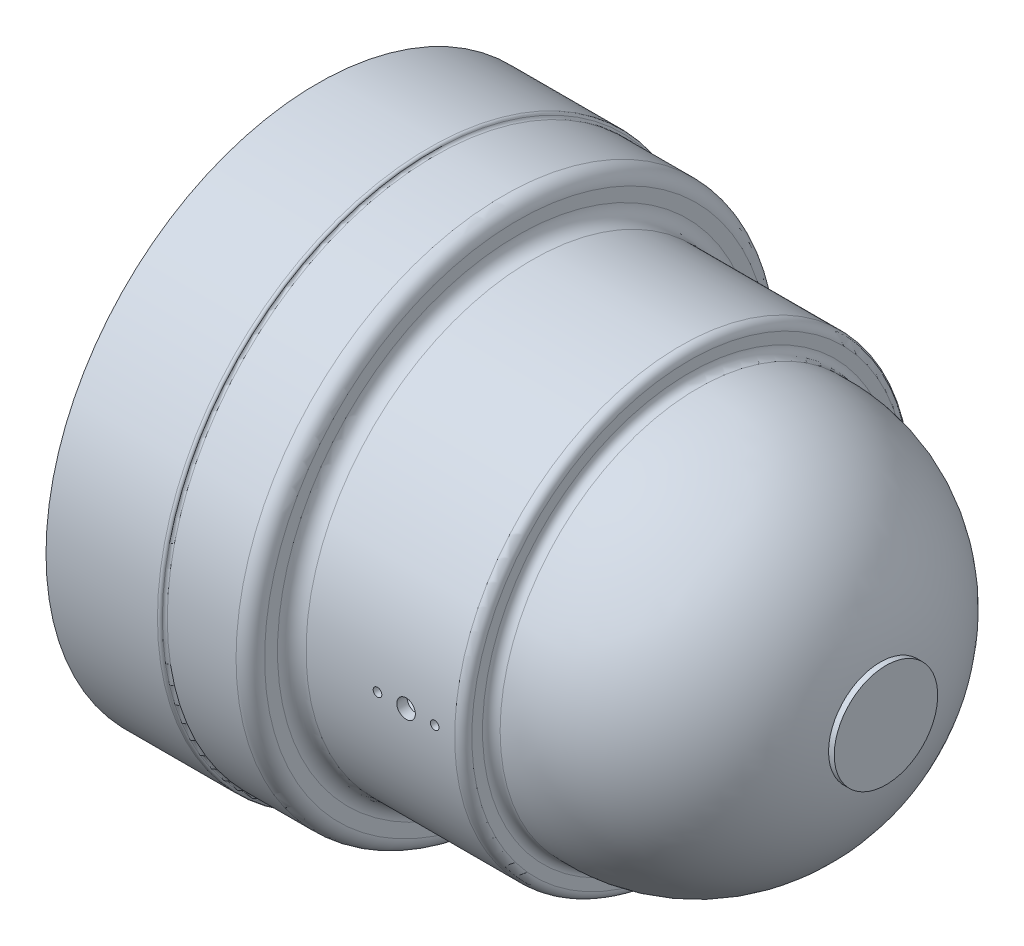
ISO-10303-21;
HEADER;
FILE_DESCRIPTION(('STEP AP214'),'2;1');
FILE_NAME('part.step','',(''),(''),'','','');
FILE_SCHEMA(('AUTOMOTIVE_DESIGN { 1 0 10303 214 1 1 1 1 }'));
ENDSEC;
DATA;
#1=APPLICATION_CONTEXT('core data for automotive mechanical design processes');
#2=APPLICATION_PROTOCOL_DEFINITION('international standard','automotive_design',2000,#1);
#3=PRODUCT_CONTEXT('',#1,'mechanical');
#4=PRODUCT('Part','Part','',(#3));
#5=PRODUCT_RELATED_PRODUCT_CATEGORY('part','',(#4));
#6=PRODUCT_DEFINITION_FORMATION('','',#4);
#7=PRODUCT_DEFINITION_CONTEXT('part definition',#1,'design');
#8=PRODUCT_DEFINITION('design','',#6,#7);
#9=PRODUCT_DEFINITION_SHAPE('','',#8);
#10=(LENGTH_UNIT() NAMED_UNIT(*) SI_UNIT(.MILLI.,.METRE.));
#11=(NAMED_UNIT(*) PLANE_ANGLE_UNIT() SI_UNIT($,.RADIAN.));
#12=(NAMED_UNIT(*) SI_UNIT($,.STERADIAN.) SOLID_ANGLE_UNIT());
#13=UNCERTAINTY_MEASURE_WITH_UNIT(LENGTH_MEASURE(1.E-05),#10,'distance_accuracy_value','');
#14=(GEOMETRIC_REPRESENTATION_CONTEXT(3) GLOBAL_UNCERTAINTY_ASSIGNED_CONTEXT((#13)) GLOBAL_UNIT_ASSIGNED_CONTEXT((#10,
#11,#12)) REPRESENTATION_CONTEXT('',''));
#15=CARTESIAN_POINT('',(0.,0.,0.));
#16=DIRECTION('',(0.,0.,1.));
#17=DIRECTION('',(1.,0.,0.));
#18=AXIS2_PLACEMENT_3D('',#15,#16,#17);
#19=CARTESIAN_POINT('',(-213.014331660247,0.,0.));
#20=DIRECTION('',(-1.,0.,0.));
#21=DIRECTION('',(0.,0.,1.));
#22=AXIS2_PLACEMENT_3D('',#19,#20,#21);
#23=CYLINDRICAL_SURFACE('',#22,79.);
#24=CARTESIAN_POINT('',(-28.5,0.,79.));
#25=CARTESIAN_POINT('',(-28.5000037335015,-0.0842475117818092,78.9999998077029));
#26=CARTESIAN_POINT('',(-28.5071214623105,-0.168555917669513,78.9998637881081));
#27=CARTESIAN_POINT('',(-28.5354164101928,-0.334850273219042,78.9993342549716));
#28=CARTESIAN_POINT('',(-28.556610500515,-0.416833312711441,78.9989404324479));
#29=CARTESIAN_POINT('',(-28.6124541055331,-0.576043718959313,78.9979399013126));
#30=CARTESIAN_POINT('',(-28.6470971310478,-0.653273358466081,78.9973332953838));
#31=CARTESIAN_POINT('',(-28.7288461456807,-0.800798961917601,78.9959756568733));
#32=CARTESIAN_POINT('',(-28.7759490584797,-0.871096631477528,78.9952246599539));
#33=CARTESIAN_POINT('',(-28.881296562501,-1.00280355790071,78.9936626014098));
#34=CARTESIAN_POINT('',(-28.9395435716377,-1.06421088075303,78.9928515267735));
#35=CARTESIAN_POINT('',(-29.0655224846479,-1.17637800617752,78.9912608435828));
#36=CARTESIAN_POINT('',(-29.1332547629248,-1.2271373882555,78.9904812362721));
#37=CARTESIAN_POINT('',(-29.2762847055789,-1.31656764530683,78.989041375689));
#38=CARTESIAN_POINT('',(-29.3515828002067,-1.35523783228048,78.9883811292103));
#39=CARTESIAN_POINT('',(-29.5076037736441,-1.41938731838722,78.987254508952));
#40=CARTESIAN_POINT('',(-29.5883266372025,-1.44486665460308,78.9867881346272));
#41=CARTESIAN_POINT('',(-29.7528954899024,-1.4819083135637,78.9861019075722));
#42=CARTESIAN_POINT('',(-29.836741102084,-1.49347231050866,78.9858820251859));
#43=CARTESIAN_POINT('',(-30.0051837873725,-1.50236017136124,78.9857134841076));
#44=CARTESIAN_POINT('',(-30.0897808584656,-1.49968407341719,78.9857648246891));
#45=CARTESIAN_POINT('',(-30.257313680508,-1.48016917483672,78.9861329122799));
#46=CARTESIAN_POINT('',(-30.3402496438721,-1.46333219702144,78.98644962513));
#47=CARTESIAN_POINT('',(-30.5021176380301,-1.41597628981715,78.9873126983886));
#48=CARTESIAN_POINT('',(-30.5810496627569,-1.38545733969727,78.9878590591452));
#49=CARTESIAN_POINT('',(-30.7326749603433,-1.31160172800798,78.9891198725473));
#50=CARTESIAN_POINT('',(-30.8053678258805,-1.26826423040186,78.9898343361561));
#51=CARTESIAN_POINT('',(-30.9424468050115,-1.17000237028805,78.9913507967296));
#52=CARTESIAN_POINT('',(-31.0068329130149,-1.11507799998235,78.9921527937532));
#53=CARTESIAN_POINT('',(-31.1254813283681,-0.995191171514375,78.9937540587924));
#54=CARTESIAN_POINT('',(-31.1797420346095,-0.930227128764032,78.9945533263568));
#55=CARTESIAN_POINT('',(-31.2765870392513,-0.792110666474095,78.9960589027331));
#56=CARTESIAN_POINT('',(-31.3191713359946,-0.71895824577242,78.9967652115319));
#57=CARTESIAN_POINT('',(-31.3914544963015,-0.56654072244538,78.9980052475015));
#58=CARTESIAN_POINT('',(-31.4211533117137,-0.48727559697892,78.9985389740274));
#59=CARTESIAN_POINT('',(-31.4668214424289,-0.324883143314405,78.9993736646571));
#60=CARTESIAN_POINT('',(-31.4827907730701,-0.241755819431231,78.9996746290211));
#61=CARTESIAN_POINT('',(-31.5005446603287,-0.0740125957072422,79.0000098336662));
#62=CARTESIAN_POINT('',(-31.502331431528,0.0106030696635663,79.0000441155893));
#63=CARTESIAN_POINT('',(-31.491675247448,0.178933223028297,78.9998422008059));
#64=CARTESIAN_POINT('',(-31.4792322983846,0.262647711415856,78.9996060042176));
#65=CARTESIAN_POINT('',(-31.4404717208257,0.426792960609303,78.9988897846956));
#66=CARTESIAN_POINT('',(-31.4141550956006,0.507223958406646,78.9984097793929));
#67=CARTESIAN_POINT('',(-31.3483952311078,0.662526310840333,78.997260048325));
#68=CARTESIAN_POINT('',(-31.3089519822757,0.737397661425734,78.9965903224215));
#69=CARTESIAN_POINT('',(-31.2180528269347,0.879465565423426,78.9951365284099));
#70=CARTESIAN_POINT('',(-31.1665954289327,0.94666116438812,78.9943524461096));
#71=CARTESIAN_POINT('',(-31.0531308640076,1.07146053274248,78.992758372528));
#72=CARTESIAN_POINT('',(-30.9911236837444,1.12906429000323,78.9919483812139));
#73=CARTESIAN_POINT('',(-30.858310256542,1.23305215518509,78.9903936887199));
#74=CARTESIAN_POINT('',(-30.7875028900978,1.27943483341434,78.9896489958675));
#75=CARTESIAN_POINT('',(-30.6391048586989,1.35965408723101,78.9883089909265));
#76=CARTESIAN_POINT('',(-30.5615142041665,1.39349068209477,78.9877136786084));
#77=CARTESIAN_POINT('',(-30.4017575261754,1.4476547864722,78.9867396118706));
#78=CARTESIAN_POINT('',(-30.3195918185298,1.46798322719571,78.9863608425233));
#79=CARTESIAN_POINT('',(-30.1530128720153,1.49455703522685,78.9858625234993));
#80=CARTESIAN_POINT('',(-30.0685996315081,1.50080239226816,78.9857429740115));
#81=CARTESIAN_POINT('',(-29.8999363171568,1.49903260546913,78.9857765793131));
#82=CARTESIAN_POINT('',(-29.8156862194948,1.49101972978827,78.9859296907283));
#83=CARTESIAN_POINT('',(-29.6497272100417,1.46096556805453,78.9864912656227));
#84=CARTESIAN_POINT('',(-29.5680183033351,1.43892425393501,78.9868997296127));
#85=CARTESIAN_POINT('',(-29.4094594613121,1.38143889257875,78.9879259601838));
#86=CARTESIAN_POINT('',(-29.3326096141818,1.34599460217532,78.9885437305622));
#87=CARTESIAN_POINT('',(-29.1859537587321,1.26271111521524,78.9899188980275));
#88=CARTESIAN_POINT('',(-29.1161474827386,1.21487238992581,78.9906762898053));
#89=CARTESIAN_POINT('',(-28.9855520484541,1.10815480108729,78.9922453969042));
#90=CARTESIAN_POINT('',(-28.9247633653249,1.0492753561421,78.9930571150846));
#91=CARTESIAN_POINT('',(-28.8139178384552,0.922129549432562,78.9946435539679));
#92=CARTESIAN_POINT('',(-28.7638636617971,0.853860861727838,78.995418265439));
#93=CARTESIAN_POINT('',(-28.6759044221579,0.70985667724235,78.996843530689));
#94=CARTESIAN_POINT('',(-28.6380060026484,0.634117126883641,78.9974940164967));
#95=CARTESIAN_POINT('',(-28.5755066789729,0.477408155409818,78.998596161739));
#96=CARTESIAN_POINT('',(-28.5508898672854,0.396445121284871,78.9990480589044));
#97=CARTESIAN_POINT('',(-28.5221985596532,0.262473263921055,78.9995809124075));
#98=CARTESIAN_POINT('',(-28.5138845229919,0.210334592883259,78.9997373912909));
#99=CARTESIAN_POINT('',(-28.5027840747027,0.105471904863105,78.9999469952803));
#100=CARTESIAN_POINT('',(-28.4999976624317,0.0527478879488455,79.0000001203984));
#101=CARTESIAN_POINT('',(-28.5,0.,79.));
#102=B_SPLINE_CURVE_WITH_KNOTS('',3,(#24,#25,#26,#27,#28,#29,#30,#31,#32,#33,#34,#35,#36,#37,
#38,#39,#40,#41,#42,#43,#44,#45,#46,#47,#48,#49,#50,#51,#52,#53,#54,#55,#56,#57,#58,#59,#60,#61,
#62,#63,#64,#65,#66,#67,#68,#69,#70,#71,#72,#73,#74,#75,#76,#77,#78,#79,#80,#81,#82,#83,#84,#85,
#86,#87,#88,#89,#90,#91,#92,#93,#94,#95,#96,#97,#98,#99,#100,#101),.UNSPECIFIED.,.T.,.F.,(4,2,2,
2,2,2,2,2,2,2,2,2,2,2,2,2,2,2,2,2,2,2,2,2,2,2,2,2,2,2,2,2,2,2,2,2,2,2,4),(0.,0.252550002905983,
0.505403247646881,0.758134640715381,1.01080369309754,1.26352762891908,1.51626154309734,
1.76900983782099,2.02175742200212,2.2744745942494,2.52719108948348,2.77987505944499,
3.03255941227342,3.28526024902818,3.5379612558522,3.79070218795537,4.04344315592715,
4.29618506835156,4.54892669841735,4.80162886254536,5.05433091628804,5.30701469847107,
5.55969866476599,5.8124140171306,6.06512968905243,6.31787754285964,6.57062500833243,
6.82335504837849,7.07608527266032,7.3287752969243,7.5814658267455,7.83416094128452,
8.08684644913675,8.33954526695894,8.59230679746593,8.84520623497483,9.09780209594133,
9.25592523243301,9.41404835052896),.UNSPECIFIED.);
#103=CARTESIAN_POINT('',(-28.5,0.,79.));
#104=VERTEX_POINT('',#103);
#105=EDGE_CURVE('E60',#104,#104,#102,.T.);
#106=ORIENTED_EDGE('',*,*,#105,.T.);
#107=EDGE_LOOP('',(#106));
#108=FACE_BOUND('',#107,.T.);
#109=CARTESIAN_POINT('',(-55.,0.,0.));
#110=DIRECTION('',(1.,0.,0.));
#111=DIRECTION('',(0.,0.,-1.));
#112=AXIS2_PLACEMENT_3D('',#109,#110,#111);
#113=CIRCLE('',#112,79.);
#114=CARTESIAN_POINT('',(-55.,0.,-79.));
#115=VERTEX_POINT('',#114);
#116=EDGE_CURVE('E187',#115,#115,#113,.T.);
#117=ORIENTED_EDGE('',*,*,#116,.T.);
#118=EDGE_LOOP('',(#117));
#119=FACE_BOUND('',#118,.T.);
#120=CARTESIAN_POINT('',(-2.99999999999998,0.,0.));
#121=DIRECTION('',(1.,0.,0.));
#122=DIRECTION('',(0.,0.,-1.));
#123=AXIS2_PLACEMENT_3D('',#120,#121,#122);
#124=CIRCLE('',#123,79.);
#125=CARTESIAN_POINT('',(-2.99999999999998,0.,-79.));
#126=VERTEX_POINT('',#125);
#127=EDGE_CURVE('E10',#126,#126,#124,.F.);
#128=ORIENTED_EDGE('',*,*,#127,.T.);
#129=EDGE_LOOP('',(#128));
#130=FACE_BOUND('',#129,.T.);
#131=CARTESIAN_POINT('',(-16.75,0.,79.));
#132=CARTESIAN_POINT('',(-16.750008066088,-0.182471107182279,78.9999991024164));
#133=CARTESIAN_POINT('',(-16.7654188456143,-0.365072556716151,78.9993610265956));
#134=CARTESIAN_POINT('',(-16.8266784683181,-0.7252408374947,78.9968769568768));
#135=CARTESIAN_POINT('',(-16.8725634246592,-0.902801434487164,78.9950295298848));
#136=CARTESIAN_POINT('',(-16.9934578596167,-1.24761832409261,78.9903359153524));
#137=CARTESIAN_POINT('',(-17.0684527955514,-1.41487971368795,78.9874902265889));
#138=CARTESIAN_POINT('',(-17.2454167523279,-1.7343932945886,78.9811208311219));
#139=CARTESIAN_POINT('',(-17.3473792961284,-1.88664907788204,78.9775972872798));
#140=CARTESIAN_POINT('',(-17.5754684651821,-2.17198679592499,78.9702658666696));
#141=CARTESIAN_POINT('',(-17.701610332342,-2.30505654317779,78.9664578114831));
#142=CARTESIAN_POINT('',(-17.97444820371,-2.54814139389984,78.9589881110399));
#143=CARTESIAN_POINT('',(-18.1211450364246,-2.65815556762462,78.9553264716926));
#144=CARTESIAN_POINT('',(-18.4309867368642,-2.85203541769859,78.9485613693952));
#145=CARTESIAN_POINT('',(-18.5941371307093,-2.93589226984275,78.9454580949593));
#146=CARTESIAN_POINT('',(-18.9322156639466,-3.07502026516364,78.9401616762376));
#147=CARTESIAN_POINT('',(-19.1071437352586,-3.13029157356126,78.9379685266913));
#148=CARTESIAN_POINT('',(-19.4637061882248,-3.21064921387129,78.9347411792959));
#149=CARTESIAN_POINT('',(-19.6453366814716,-3.23575277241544,78.9337063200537));
#150=CARTESIAN_POINT('',(-20.0102364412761,-3.25511543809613,78.9329102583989));
#151=CARTESIAN_POINT('',(-20.1935056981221,-3.24937472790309,78.9331490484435));
#152=CARTESIAN_POINT('',(-20.5563636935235,-3.20722622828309,78.9348727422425));
#153=CARTESIAN_POINT('',(-20.7359545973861,-3.17083704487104,78.9363568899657));
#154=CARTESIAN_POINT('',(-21.0864765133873,-3.06845336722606,78.9404028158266));
#155=CARTESIAN_POINT('',(-21.2574074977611,-3.00245877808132,78.9429645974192));
#156=CARTESIAN_POINT('',(-21.5858174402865,-2.8427163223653,78.9488779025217));
#157=CARTESIAN_POINT('',(-21.7432922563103,-2.7489599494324,78.9522296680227));
#158=CARTESIAN_POINT('',(-22.0402743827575,-2.53636156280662,78.9593448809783));
#159=CARTESIAN_POINT('',(-22.1797816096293,-2.41751943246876,78.9631083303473));
#160=CARTESIAN_POINT('',(-22.4369767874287,-2.1580179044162,78.9706260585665));
#161=CARTESIAN_POINT('',(-22.5546484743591,-2.01734238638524,78.974380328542));
#162=CARTESIAN_POINT('',(-22.764707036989,-1.71822409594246,78.9814538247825));
#163=CARTESIAN_POINT('',(-22.8570939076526,-1.55978131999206,78.9847730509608));
#164=CARTESIAN_POINT('',(-23.0139586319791,-1.22961683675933,78.9906024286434));
#165=CARTESIAN_POINT('',(-23.0784359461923,-1.05789487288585,78.993112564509));
#166=CARTESIAN_POINT('',(-23.1776407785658,-0.706050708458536,78.997040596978));
#167=CARTESIAN_POINT('',(-23.2123684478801,-0.525928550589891,78.9984584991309));
#168=CARTESIAN_POINT('',(-23.2510682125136,-0.162538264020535,79.0000415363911));
#169=CARTESIAN_POINT('',(-23.2550628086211,0.0207274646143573,79.0002075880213));
#170=CARTESIAN_POINT('',(-23.2322417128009,0.385326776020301,78.9992706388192));
#171=CARTESIAN_POINT('',(-23.205426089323,0.566660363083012,78.9981676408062));
#172=CARTESIAN_POINT('',(-23.1217643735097,0.922185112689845,78.9948174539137));
#173=CARTESIAN_POINT('',(-23.0649285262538,1.09637869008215,78.9925706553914));
#174=CARTESIAN_POINT('',(-22.9228501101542,1.43275297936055,78.9871859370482));
#175=CARTESIAN_POINT('',(-22.8376074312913,1.59493364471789,78.984048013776));
#176=CARTESIAN_POINT('',(-22.6410772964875,1.90278184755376,78.9772320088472));
#177=CARTESIAN_POINT('',(-22.5297747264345,2.04843972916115,78.9735536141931));
#178=CARTESIAN_POINT('',(-22.2843064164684,2.31901064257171,78.9660721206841));
#179=CARTESIAN_POINT('',(-22.1501405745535,2.44392358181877,78.9622690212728));
#180=CARTESIAN_POINT('',(-21.8626575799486,2.669534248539,78.9549642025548));
#181=CARTESIAN_POINT('',(-21.7093290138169,2.77021743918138,78.9514626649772));
#182=CARTESIAN_POINT('',(-21.3879309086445,2.94441124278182,78.9451586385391));
#183=CARTESIAN_POINT('',(-21.2198614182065,3.01792194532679,78.9423561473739));
#184=CARTESIAN_POINT('',(-20.8738066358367,3.13565864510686,78.9377675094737));
#185=CARTESIAN_POINT('',(-20.6958245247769,3.1798939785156,78.9359810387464));
#186=CARTESIAN_POINT('',(-20.3349520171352,3.23785482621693,78.9336249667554));
#187=CARTESIAN_POINT('',(-20.152061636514,3.25158043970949,78.933055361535));
#188=CARTESIAN_POINT('',(-19.7867091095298,3.24813116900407,78.9331973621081));
#189=CARTESIAN_POINT('',(-19.6042467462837,3.23097917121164,78.9339080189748));
#190=CARTESIAN_POINT('',(-19.2447940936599,3.16630877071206,78.9365284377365));
#191=CARTESIAN_POINT('',(-19.0678038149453,3.11879030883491,78.938438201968));
#192=CARTESIAN_POINT('',(-18.7243133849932,2.9947400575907,78.9432413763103));
#193=CARTESIAN_POINT('',(-18.5578133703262,2.91820789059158,78.9461347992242));
#194=CARTESIAN_POINT('',(-18.2400262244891,2.73830770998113,78.952579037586));
#195=CARTESIAN_POINT('',(-18.0887385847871,2.63494059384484,78.9561298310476));
#196=CARTESIAN_POINT('',(-17.8055588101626,2.40422661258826,78.9634914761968));
#197=CARTESIAN_POINT('',(-17.6736790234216,2.2768645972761,78.9673024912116));
#198=CARTESIAN_POINT('',(-17.4331341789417,2.00177104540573,78.9747542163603));
#199=CARTESIAN_POINT('',(-17.3244748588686,1.85403448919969,78.978394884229));
#200=CARTESIAN_POINT('',(-17.133421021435,1.542299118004,78.9850974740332));
#201=CARTESIAN_POINT('',(-17.0510476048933,1.3782873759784,78.9881589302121));
#202=CARTESIAN_POINT('',(-16.9151036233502,1.03887400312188,78.9933505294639));
#203=CARTESIAN_POINT('',(-16.8614988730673,0.863486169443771,78.9954817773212));
#204=CARTESIAN_POINT('',(-16.7987478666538,0.57249946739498,78.9980061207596));
#205=CARTESIAN_POINT('',(-16.7804905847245,0.458787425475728,78.9987505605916));
#206=CARTESIAN_POINT('',(-16.7561141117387,0.23006753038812,78.9997477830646));
#207=CARTESIAN_POINT('',(-16.7499949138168,0.11505967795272,79.0000005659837));
#208=CARTESIAN_POINT('',(-16.75,0.,79.));
#209=B_SPLINE_CURVE_WITH_KNOTS('',3,(#131,#132,#133,#134,#135,#136,#137,#138,#139,#140,#141,
#142,#143,#144,#145,#146,#147,#148,#149,#150,#151,#152,#153,#154,#155,#156,#157,#158,#159,#160,
#161,#162,#163,#164,#165,#166,#167,#168,#169,#170,#171,#172,#173,#174,#175,#176,#177,#178,#179,
#180,#181,#182,#183,#184,#185,#186,#187,#188,#189,#190,#191,#192,#193,#194,#195,#196,#197,#198,
#199,#200,#201,#202,#203,#204,#205,#206,#207,#208),.UNSPECIFIED.,.T.,.F.,(4,2,2,2,2,2,2,2,2,2,2,
2,2,2,2,2,2,2,2,2,2,2,2,2,2,2,2,2,2,2,2,2,2,2,2,2,2,2,4),(0.,0.54699332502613,1.09463601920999,
1.64200547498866,2.189243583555,2.73682779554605,3.28443408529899,3.8322249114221,
4.38001257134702,4.92748728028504,5.4749587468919,6.02209809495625,6.56923919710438,
7.11654812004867,7.66385958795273,8.2115770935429,8.75929470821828,9.30702290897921,
9.85474832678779,10.4020726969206,10.949395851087,11.4965323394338,12.0436709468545,
12.5911276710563,13.1385868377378,13.6863736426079,14.2341586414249,14.7817688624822,
15.3293773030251,15.8765800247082,16.423783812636,16.9709947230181,17.5181873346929,
18.0657266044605,18.6134010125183,19.1615139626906,19.7089741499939,20.0538885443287,
20.3988027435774),.UNSPECIFIED.);
#210=CARTESIAN_POINT('',(-16.75,0.,79.));
#211=VERTEX_POINT('',#210);
#212=EDGE_CURVE('E59',#211,#211,#209,.T.);
#213=ORIENTED_EDGE('',*,*,#212,.T.);
#214=EDGE_LOOP('',(#213));
#215=FACE_BOUND('',#214,.T.);
#216=CARTESIAN_POINT('',(-8.50000000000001,0.,79.));
#217=CARTESIAN_POINT('',(-8.50000373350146,-0.0842475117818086,78.9999998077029));
#218=CARTESIAN_POINT('',(-8.50712146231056,-0.168555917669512,78.9998637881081));
#219=CARTESIAN_POINT('',(-8.53541641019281,-0.334850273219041,78.9993342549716));
#220=CARTESIAN_POINT('',(-8.55661050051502,-0.41683331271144,78.9989404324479));
#221=CARTESIAN_POINT('',(-8.61245410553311,-0.576043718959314,78.9979399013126));
#222=CARTESIAN_POINT('',(-8.64709713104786,-0.653273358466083,78.9973332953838));
#223=CARTESIAN_POINT('',(-8.72884614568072,-0.800798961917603,78.9959756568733));
#224=CARTESIAN_POINT('',(-8.77594905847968,-0.87109663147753,78.9952246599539));
#225=CARTESIAN_POINT('',(-8.88129656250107,-1.00280355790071,78.9936626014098));
#226=CARTESIAN_POINT('',(-8.93954357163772,-1.06421088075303,78.9928515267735));
#227=CARTESIAN_POINT('',(-9.06552248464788,-1.17637800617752,78.9912608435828));
#228=CARTESIAN_POINT('',(-9.13325476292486,-1.2271373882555,78.9904812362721));
#229=CARTESIAN_POINT('',(-9.2762847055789,-1.31656764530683,78.989041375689));
#230=CARTESIAN_POINT('',(-9.35158280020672,-1.35523783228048,78.9883811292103));
#231=CARTESIAN_POINT('',(-9.5076037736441,-1.41938731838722,78.987254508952));
#232=CARTESIAN_POINT('',(-9.58832663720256,-1.44486665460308,78.9867881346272));
#233=CARTESIAN_POINT('',(-9.75289548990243,-1.4819083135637,78.9861019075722));
#234=CARTESIAN_POINT('',(-9.83674110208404,-1.49347231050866,78.9858820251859));
#235=CARTESIAN_POINT('',(-10.0051837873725,-1.50236017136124,78.9857134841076));
#236=CARTESIAN_POINT('',(-10.0897808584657,-1.49968407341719,78.9857648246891));
#237=CARTESIAN_POINT('',(-10.257313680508,-1.48016917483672,78.9861329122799));
#238=CARTESIAN_POINT('',(-10.3402496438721,-1.46333219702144,78.98644962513));
#239=CARTESIAN_POINT('',(-10.5021176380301,-1.41597628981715,78.9873126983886));
#240=CARTESIAN_POINT('',(-10.5810496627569,-1.38545733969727,78.9878590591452));
#241=CARTESIAN_POINT('',(-10.7326749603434,-1.31160172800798,78.9891198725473));
#242=CARTESIAN_POINT('',(-10.8053678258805,-1.26826423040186,78.9898343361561));
#243=CARTESIAN_POINT('',(-10.9424468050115,-1.17000237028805,78.9913507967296));
#244=CARTESIAN_POINT('',(-11.0068329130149,-1.11507799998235,78.9921527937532));
#245=CARTESIAN_POINT('',(-11.1254813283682,-0.995191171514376,78.9937540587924));
#246=CARTESIAN_POINT('',(-11.1797420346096,-0.930227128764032,78.9945533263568));
#247=CARTESIAN_POINT('',(-11.2765870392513,-0.792110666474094,78.9960589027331));
#248=CARTESIAN_POINT('',(-11.3191713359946,-0.718958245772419,78.9967652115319));
#249=CARTESIAN_POINT('',(-11.3914544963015,-0.566540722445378,78.9980052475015));
#250=CARTESIAN_POINT('',(-11.4211533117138,-0.487275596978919,78.9985389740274));
#251=CARTESIAN_POINT('',(-11.4668214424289,-0.324883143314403,78.9993736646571));
#252=CARTESIAN_POINT('',(-11.4827907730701,-0.241755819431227,78.9996746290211));
#253=CARTESIAN_POINT('',(-11.5005446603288,-0.0740125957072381,79.0000098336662));
#254=CARTESIAN_POINT('',(-11.502331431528,0.0106030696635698,79.0000441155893));
#255=CARTESIAN_POINT('',(-11.491675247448,0.178933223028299,78.9998422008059));
#256=CARTESIAN_POINT('',(-11.4792322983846,0.262647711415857,78.9996060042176));
#257=CARTESIAN_POINT('',(-11.4404717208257,0.426792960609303,78.9988897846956));
#258=CARTESIAN_POINT('',(-11.4141550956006,0.507223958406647,78.9984097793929));
#259=CARTESIAN_POINT('',(-11.3483952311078,0.662526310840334,78.997260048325));
#260=CARTESIAN_POINT('',(-11.3089519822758,0.737397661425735,78.9965903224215));
#261=CARTESIAN_POINT('',(-11.2180528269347,0.879465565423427,78.9951365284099));
#262=CARTESIAN_POINT('',(-11.1665954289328,0.946661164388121,78.9943524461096));
#263=CARTESIAN_POINT('',(-11.0531308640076,1.07146053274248,78.992758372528));
#264=CARTESIAN_POINT('',(-10.9911236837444,1.12906429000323,78.9919483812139));
#265=CARTESIAN_POINT('',(-10.858310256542,1.23305215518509,78.9903936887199));
#266=CARTESIAN_POINT('',(-10.7875028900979,1.27943483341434,78.9896489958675));
#267=CARTESIAN_POINT('',(-10.639104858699,1.35965408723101,78.9883089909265));
#268=CARTESIAN_POINT('',(-10.5615142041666,1.39349068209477,78.9877136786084));
#269=CARTESIAN_POINT('',(-10.4017575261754,1.4476547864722,78.9867396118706));
#270=CARTESIAN_POINT('',(-10.3195918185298,1.46798322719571,78.9863608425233));
#271=CARTESIAN_POINT('',(-10.1530128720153,1.49455703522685,78.9858625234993));
#272=CARTESIAN_POINT('',(-10.0685996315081,1.50080239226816,78.9857429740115));
#273=CARTESIAN_POINT('',(-9.89993631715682,1.49903260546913,78.9857765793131));
#274=CARTESIAN_POINT('',(-9.81568621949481,1.49101972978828,78.9859296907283));
#275=CARTESIAN_POINT('',(-9.64972721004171,1.46096556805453,78.9864912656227));
#276=CARTESIAN_POINT('',(-9.5680183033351,1.43892425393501,78.9868997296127));
#277=CARTESIAN_POINT('',(-9.4094594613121,1.38143889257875,78.9879259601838));
#278=CARTESIAN_POINT('',(-9.33260961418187,1.34599460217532,78.9885437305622));
#279=CARTESIAN_POINT('',(-9.1859537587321,1.26271111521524,78.9899188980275));
#280=CARTESIAN_POINT('',(-9.11614748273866,1.21487238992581,78.9906762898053));
#281=CARTESIAN_POINT('',(-8.98555204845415,1.10815480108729,78.9922453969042));
#282=CARTESIAN_POINT('',(-8.9247633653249,1.0492753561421,78.9930571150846));
#283=CARTESIAN_POINT('',(-8.81391783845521,0.922129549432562,78.9946435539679));
#284=CARTESIAN_POINT('',(-8.76386366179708,0.853860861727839,78.995418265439));
#285=CARTESIAN_POINT('',(-8.67590442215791,0.709856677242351,78.996843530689));
#286=CARTESIAN_POINT('',(-8.63800600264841,0.634117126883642,78.9974940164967));
#287=CARTESIAN_POINT('',(-8.57550667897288,0.477408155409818,78.998596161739));
#288=CARTESIAN_POINT('',(-8.55088986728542,0.39644512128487,78.9990480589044));
#289=CARTESIAN_POINT('',(-8.52219855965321,0.262473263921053,78.9995809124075));
#290=CARTESIAN_POINT('',(-8.51388452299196,0.210334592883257,78.9997373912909));
#291=CARTESIAN_POINT('',(-8.50278407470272,0.105471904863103,78.9999469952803));
#292=CARTESIAN_POINT('',(-8.49999766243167,0.0527478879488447,79.0000001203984));
#293=CARTESIAN_POINT('',(-8.50000000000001,0.,79.));
#294=B_SPLINE_CURVE_WITH_KNOTS('',3,(#216,#217,#218,#219,#220,#221,#222,#223,#224,#225,#226,
#227,#228,#229,#230,#231,#232,#233,#234,#235,#236,#237,#238,#239,#240,#241,#242,#243,#244,#245,
#246,#247,#248,#249,#250,#251,#252,#253,#254,#255,#256,#257,#258,#259,#260,#261,#262,#263,#264,
#265,#266,#267,#268,#269,#270,#271,#272,#273,#274,#275,#276,#277,#278,#279,#280,#281,#282,#283,
#284,#285,#286,#287,#288,#289,#290,#291,#292,#293),.UNSPECIFIED.,.T.,.F.,(4,2,2,2,2,2,2,2,2,2,2,
2,2,2,2,2,2,2,2,2,2,2,2,2,2,2,2,2,2,2,2,2,2,2,2,2,2,2,4),(0.,0.252550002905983,
0.505403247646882,0.758134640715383,1.01080369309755,1.26352762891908,1.51626154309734,
1.769009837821,2.02175742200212,2.2744745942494,2.52719108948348,2.77987505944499,
3.03255941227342,3.28526024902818,3.53796125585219,3.79070218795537,4.04344315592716,
4.29618506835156,4.54892669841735,4.80162886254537,5.05433091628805,5.30701469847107,
5.559698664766,5.8124140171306,6.06512968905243,6.31787754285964,6.57062500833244,
6.82335504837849,7.07608527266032,7.3287752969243,7.58146582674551,7.83416094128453,
8.08684644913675,8.33954526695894,8.59230679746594,8.84520623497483,9.09780209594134,
9.25592523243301,9.41404835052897),.UNSPECIFIED.);
#295=CARTESIAN_POINT('',(-8.50000000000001,0.,79.));
#296=VERTEX_POINT('',#295);
#297=EDGE_CURVE('E103',#296,#296,#294,.T.);
#298=ORIENTED_EDGE('',*,*,#297,.T.);
#299=EDGE_LOOP('',(#298));
#300=FACE_BOUND('',#299,.T.);
#301=ADVANCED_FACE('F33',(#108,#119,#130,#215,#300),#23,.T.);
#302=CARTESIAN_POINT('',(-213.014331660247,0.,0.));
#303=DIRECTION('',(-1.,0.,0.));
#304=DIRECTION('',(0.,0.,1.));
#305=AXIS2_PLACEMENT_3D('',#302,#303,#304);
#306=CYLINDRICAL_SURFACE('',#305,75.4);
#307=CARTESIAN_POINT('',(-28.5,0.,75.4));
#308=CARTESIAN_POINT('',(-28.5000037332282,-0.0842467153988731,75.3999997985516));
#309=CARTESIAN_POINT('',(-28.5071213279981,-0.16855430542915,75.3998572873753));
#310=CARTESIAN_POINT('',(-28.53541571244,-0.334846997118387,75.399302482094));
#311=CARTESIAN_POINT('',(-28.5566093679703,-0.416829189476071,75.3988898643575));
#312=CARTESIAN_POINT('',(-28.6124517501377,-0.576037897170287,75.3978415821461));
#313=CARTESIAN_POINT('',(-28.6470939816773,-0.65326668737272,75.3972060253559));
#314=CARTESIAN_POINT('',(-28.7288410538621,-0.800790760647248,75.3957835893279));
#315=CARTESIAN_POINT('',(-28.775942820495,-0.871087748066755,75.3949967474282));
#316=CARTESIAN_POINT('',(-28.8812883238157,-1.00279434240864,75.3933601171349));
#317=CARTESIAN_POINT('',(-28.9395346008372,-1.06420191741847,75.3925103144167));
#318=CARTESIAN_POINT('',(-29.0655120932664,-1.176369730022,75.3908436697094));
#319=CARTESIAN_POINT('',(-29.133243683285,-1.2271295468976,75.3900268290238));
#320=CARTESIAN_POINT('',(-29.2762729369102,-1.31656120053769,75.3885181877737));
#321=CARTESIAN_POINT('',(-29.3515710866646,-1.35523225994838,75.3878263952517));
#322=CARTESIAN_POINT('',(-29.5075924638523,-1.41938342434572,75.3866459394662));
#323=CARTESIAN_POINT('',(-29.5883156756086,-1.44486356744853,75.3861572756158));
#324=CARTESIAN_POINT('',(-29.7528844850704,-1.48190645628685,75.3854382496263));
#325=CARTESIAN_POINT('',(-29.8367296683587,-1.49347104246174,75.3852078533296));
#326=CARTESIAN_POINT('',(-30.0051716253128,-1.50236019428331,75.3850312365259));
#327=CARTESIAN_POINT('',(-30.0897683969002,-1.49968479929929,75.3850850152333));
#328=CARTESIAN_POINT('',(-30.2572996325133,-1.48017153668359,75.3854706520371));
#329=CARTESIAN_POINT('',(-30.3402343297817,-1.46333567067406,75.3858024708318));
#330=CARTESIAN_POINT('',(-30.5020999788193,-1.41598246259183,75.3867067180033));
#331=CARTESIAN_POINT('',(-30.581030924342,-1.38546509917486,75.3872791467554));
#332=CARTESIAN_POINT('',(-30.7326548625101,-1.31161288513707,75.388600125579));
#333=CARTESIAN_POINT('',(-30.8053474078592,-1.26827711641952,75.389348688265));
#334=CARTESIAN_POINT('',(-30.9424261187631,-1.17001894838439,75.3909375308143));
#335=CARTESIAN_POINT('',(-31.0068122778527,-1.11509654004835,75.391777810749));
#336=CARTESIAN_POINT('',(-31.1254622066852,-0.99521280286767,75.3934555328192));
#337=CARTESIAN_POINT('',(-31.1797242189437,-0.930249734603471,75.3942929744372));
#338=CARTESIAN_POINT('',(-31.2765720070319,-0.79213490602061,75.3958704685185));
#339=CARTESIAN_POINT('',(-31.3191577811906,-0.718983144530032,75.3966105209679));
#340=CARTESIAN_POINT('',(-31.3914440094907,-0.566566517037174,75.3979098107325));
#341=CARTESIAN_POINT('',(-31.4211444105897,-0.487301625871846,75.3984690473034));
#342=CARTESIAN_POINT('',(-31.4668156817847,-0.324909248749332,75.3993436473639));
#343=CARTESIAN_POINT('',(-31.4827865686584,-0.241781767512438,75.3996590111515));
#344=CARTESIAN_POINT('',(-31.5005433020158,-0.0740391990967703,75.4000102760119));
#345=CARTESIAN_POINT('',(-31.5023315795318,0.0105756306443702,75.400046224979));
#346=CARTESIAN_POINT('',(-31.4916786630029,0.178904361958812,75.3998347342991));
#347=CARTESIAN_POINT('',(-31.4792374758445,0.262618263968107,75.3995872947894));
#348=CARTESIAN_POINT('',(-31.4404808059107,0.426762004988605,75.3988369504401));
#349=CARTESIAN_POINT('',(-31.4141664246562,0.507192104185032,75.3983340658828));
#350=CARTESIAN_POINT('',(-31.3484114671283,0.662493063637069,75.397129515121));
#351=CARTESIAN_POINT('',(-31.3089708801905,0.737363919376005,75.3964278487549));
#352=CARTESIAN_POINT('',(-31.2180768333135,0.879432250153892,75.3949046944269));
#353=CARTESIAN_POINT('',(-31.1666217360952,0.946628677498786,75.3940831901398));
#354=CARTESIAN_POINT('',(-31.0531617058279,1.07143015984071,75.3924130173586));
#355=CARTESIAN_POINT('',(-30.9911567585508,1.12903520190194,75.391564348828));
#356=CARTESIAN_POINT('',(-30.8583467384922,1.23302678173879,75.3899353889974));
#357=CARTESIAN_POINT('',(-30.7875404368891,1.27941175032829,75.3891551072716));
#358=CARTESIAN_POINT('',(-30.6391439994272,1.359635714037,75.3877510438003));
#359=CARTESIAN_POINT('',(-30.5615538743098,1.39347472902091,75.387127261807));
#360=CARTESIAN_POINT('',(-30.4017982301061,1.4476434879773,75.3861065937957));
#361=CARTESIAN_POINT('',(-30.3196330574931,1.46797425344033,75.3857096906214));
#362=CARTESIAN_POINT('',(-30.1530547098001,1.49455275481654,75.3851874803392));
#363=CARTESIAN_POINT('',(-30.0686415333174,1.50080048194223,75.3850621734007));
#364=CARTESIAN_POINT('',(-29.8999792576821,1.49903540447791,75.3850972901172));
#365=CARTESIAN_POINT('',(-29.8157301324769,1.4910250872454,75.3852576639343));
#366=CARTESIAN_POINT('',(-29.6497726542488,1.46097639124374,75.3858459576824));
#367=CARTESIAN_POINT('',(-29.5680643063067,1.4389379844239,75.3862738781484));
#368=CARTESIAN_POINT('',(-29.4095061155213,1.3814587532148,75.3873490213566));
#369=CARTESIAN_POINT('',(-29.3326563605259,1.34601768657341,75.3879962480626));
#370=CARTESIAN_POINT('',(-29.1860000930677,1.26274088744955,75.3894370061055));
#371=CARTESIAN_POINT('',(-29.1161933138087,1.21490562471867,75.3902305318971));
#372=CARTESIAN_POINT('',(-28.9855951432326,1.10819423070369,75.3918745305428));
#373=CARTESIAN_POINT('',(-28.9248043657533,1.04931734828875,75.3927250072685));
#374=CARTESIAN_POINT('',(-28.8139541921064,0.922176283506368,75.3943872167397));
#375=CARTESIAN_POINT('',(-28.7638974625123,0.853909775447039,75.395198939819));
#376=CARTESIAN_POINT('',(-28.6759324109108,0.709908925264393,75.3966923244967));
#377=CARTESIAN_POINT('',(-28.6380308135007,0.634170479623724,75.3973739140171));
#378=CARTESIAN_POINT('',(-28.5755250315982,0.477463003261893,75.398528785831));
#379=CARTESIAN_POINT('',(-28.5509049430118,0.396500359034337,75.3990023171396));
#380=CARTESIAN_POINT('',(-28.5222064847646,0.262519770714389,75.3995607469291));
#381=CARTESIAN_POINT('',(-28.5138894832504,0.210371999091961,75.3997247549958));
#382=CARTESIAN_POINT('',(-28.5027850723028,0.105490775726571,75.3999444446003));
#383=CARTESIAN_POINT('',(-28.4999976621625,0.0527573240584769,75.4000001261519));
#384=CARTESIAN_POINT('',(-28.5,0.,75.4));
#385=B_SPLINE_CURVE_WITH_KNOTS('',3,(#307,#308,#309,#310,#311,#312,#313,#314,#315,#316,#317,
#318,#319,#320,#321,#322,#323,#324,#325,#326,#327,#328,#329,#330,#331,#332,#333,#334,#335,#336,
#337,#338,#339,#340,#341,#342,#343,#344,#345,#346,#347,#348,#349,#350,#351,#352,#353,#354,#355,
#356,#357,#358,#359,#360,#361,#362,#363,#364,#365,#366,#367,#368,#369,#370,#371,#372,#373,#374,
#375,#376,#377,#378,#379,#380,#381,#382,#383,#384),.UNSPECIFIED.,.T.,.F.,(4,2,2,2,2,2,2,2,2,2,2,
2,2,2,2,2,2,2,2,2,2,2,2,2,2,2,2,2,2,2,2,2,2,2,2,2,2,2,4),(0.,0.252547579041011,
0.505398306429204,0.75812706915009,1.01079353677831,1.26351766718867,1.51625178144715,
1.76900214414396,2.02175177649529,2.27446797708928,2.52718347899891,2.77986326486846,
3.03254344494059,3.28524172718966,3.53794020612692,3.79068251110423,4.04342485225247,
4.29616823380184,4.54891130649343,4.80161105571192,5.05431068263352,5.30699024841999,
5.55967001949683,5.81238424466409,6.06509881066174,6.31784869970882,6.57059818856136,
6.82332856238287,7.07605909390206,7.32874554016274,7.58143249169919,7.83412401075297,
8.0868059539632,8.33950509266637,8.59226693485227,8.84516837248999,9.09776629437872,
9.25591769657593,9.41406907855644),.UNSPECIFIED.);
#386=CARTESIAN_POINT('',(-28.5,0.,75.4));
#387=VERTEX_POINT('',#386);
#388=EDGE_CURVE('E61',#387,#387,#385,.T.);
#389=ORIENTED_EDGE('',*,*,#388,.F.);
#390=EDGE_LOOP('',(#389));
#391=FACE_BOUND('',#390,.T.);
#392=CARTESIAN_POINT('',(-63.6,0.,0.));
#393=DIRECTION('',(1.,0.,0.));
#394=DIRECTION('',(0.,0.,-1.));
#395=AXIS2_PLACEMENT_3D('',#392,#393,#394);
#396=CIRCLE('',#395,75.4);
#397=CARTESIAN_POINT('',(-63.6,0.,-75.4));
#398=VERTEX_POINT('',#397);
#399=EDGE_CURVE('E134',#398,#398,#396,.F.);
#400=ORIENTED_EDGE('',*,*,#399,.T.);
#401=EDGE_LOOP('',(#400));
#402=FACE_BOUND('',#401,.T.);
#403=CARTESIAN_POINT('',(-3.59999999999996,0.,0.));
#404=DIRECTION('',(1.,0.,0.));
#405=DIRECTION('',(0.,0.,-1.));
#406=AXIS2_PLACEMENT_3D('',#403,#404,#405);
#407=CIRCLE('',#406,75.4);
#408=CARTESIAN_POINT('',(-3.59999999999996,0.,-75.4));
#409=VERTEX_POINT('',#408);
#410=EDGE_CURVE('E138',#409,#409,#407,.F.);
#411=ORIENTED_EDGE('',*,*,#410,.F.);
#412=EDGE_LOOP('',(#411));
#413=FACE_BOUND('',#412,.T.);
#414=CARTESIAN_POINT('',(-16.75,0.,75.4));
#415=CARTESIAN_POINT('',(-16.7500080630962,-0.182463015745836,75.3999990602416));
#416=CARTESIAN_POINT('',(-16.765417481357,-0.365056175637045,75.3993305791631));
#417=CARTESIAN_POINT('',(-16.8266713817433,-0.725207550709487,75.3967281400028));
#418=CARTESIAN_POINT('',(-16.8725519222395,-0.902759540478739,75.3947926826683));
#419=CARTESIAN_POINT('',(-16.9934339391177,-1.24755917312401,75.3898754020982));
#420=CARTESIAN_POINT('',(-17.0684208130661,-1.41481193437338,75.3868941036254));
#421=CARTESIAN_POINT('',(-17.2453650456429,-1.73430996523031,75.3802211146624));
#422=CARTESIAN_POINT('',(-17.3473159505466,-1.8865588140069,75.3765295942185));
#423=CARTESIAN_POINT('',(-17.5753847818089,-2.1718931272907,75.3688483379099));
#424=CARTESIAN_POINT('',(-17.7015191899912,-2.30496541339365,75.3648583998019));
#425=CARTESIAN_POINT('',(-17.9743425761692,-2.54805720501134,75.3570317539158));
#426=CARTESIAN_POINT('',(-18.121032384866,-2.65807577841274,75.3531950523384));
#427=CARTESIAN_POINT('',(-18.4308670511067,-2.85196982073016,75.3461061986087));
#428=CARTESIAN_POINT('',(-18.5940180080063,-2.93583555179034,75.3428542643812));
#429=CARTESIAN_POINT('',(-18.9321006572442,-3.07498062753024,75.3373039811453));
#430=CARTESIAN_POINT('',(-19.1070322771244,-3.13026014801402,75.3350056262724));
#431=CARTESIAN_POINT('',(-19.4635943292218,-3.21063030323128,75.3316234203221));
#432=CARTESIAN_POINT('',(-19.6452204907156,-3.23573985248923,75.3305388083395));
#433=CARTESIAN_POINT('',(-20.0101129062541,-3.25511563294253,75.3297041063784));
#434=CARTESIAN_POINT('',(-20.1933791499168,-3.24938205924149,75.3299540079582));
#435=CARTESIAN_POINT('',(-20.5562210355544,-3.2072501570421,75.3317594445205));
#436=CARTESIAN_POINT('',(-20.7357990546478,-3.17087225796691,75.3333141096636));
#437=CARTESIAN_POINT('',(-21.0862970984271,-3.06851598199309,75.3375524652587));
#438=CARTESIAN_POINT('',(-21.2572170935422,-3.00253750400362,75.3402361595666));
#439=CARTESIAN_POINT('',(-21.5856131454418,-2.84282957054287,75.3464310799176));
#440=CARTESIAN_POINT('',(-21.7430846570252,-2.74909078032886,75.3499425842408));
#441=CARTESIAN_POINT('',(-22.0400639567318,-2.53652995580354,75.3573970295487));
#442=CARTESIAN_POINT('',(-22.1795716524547,-2.41770779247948,75.3613399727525));
#443=CARTESIAN_POINT('',(-22.4367821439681,-2.15823775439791,75.3692167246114));
#444=CARTESIAN_POINT('',(-22.5544670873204,-2.01757218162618,75.3731505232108));
#445=CARTESIAN_POINT('',(-22.7645539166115,-1.71847058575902,75.3805624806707));
#446=CARTESIAN_POINT('',(-22.8569557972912,-1.56003455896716,75.3840406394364));
#447=CARTESIAN_POINT('',(-23.0138517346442,-1.22987922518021,75.3901493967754));
#448=CARTESIAN_POINT('',(-23.0783451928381,-1.05815963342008,75.3927799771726));
#449=CARTESIAN_POINT('',(-23.1775819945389,-0.706316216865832,75.3968968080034));
#450=CARTESIAN_POINT('',(-23.2123255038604,-0.526192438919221,75.398383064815));
#451=CARTESIAN_POINT('',(-23.2510542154,-0.162808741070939,75.4000429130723));
#452=CARTESIAN_POINT('',(-23.2550641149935,0.0204485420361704,75.4002175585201));
#453=CARTESIAN_POINT('',(-23.2322761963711,0.385033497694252,75.3992372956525));
#454=CARTESIAN_POINT('',(-23.2054784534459,0.566361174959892,75.3980823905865));
#455=CARTESIAN_POINT('',(-23.1218563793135,0.921870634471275,75.3945738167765));
#456=CARTESIAN_POINT('',(-23.0650432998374,1.09605506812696,75.392220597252));
#457=CARTESIAN_POINT('',(-22.9230146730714,1.43241516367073,75.3865804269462));
#458=CARTESIAN_POINT('',(-22.8377990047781,1.59459077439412,75.3832934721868));
#459=CARTESIAN_POINT('',(-22.6413207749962,1.90244317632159,75.3761531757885));
#460=CARTESIAN_POINT('',(-22.5300416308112,2.04810937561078,75.3722994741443));
#461=CARTESIAN_POINT('',(-22.2846195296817,2.31870157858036,75.3644610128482));
#462=CARTESIAN_POINT('',(-22.1504764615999,2.44362748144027,75.3604762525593));
#463=CARTESIAN_POINT('',(-21.8630282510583,2.66927579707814,75.3528218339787));
#464=CARTESIAN_POINT('',(-21.7097105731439,2.76998224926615,75.3491523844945));
#465=CARTESIAN_POINT('',(-21.3883288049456,2.94422390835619,75.3425456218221));
#466=CARTESIAN_POINT('',(-21.220264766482,3.01775921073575,75.3396083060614));
#467=CARTESIAN_POINT('',(-20.8742205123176,3.13554327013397,75.3347985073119));
#468=CARTESIAN_POINT('',(-20.6962437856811,3.17980226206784,75.332925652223));
#469=CARTESIAN_POINT('',(-20.3353772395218,3.23781085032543,75.3304549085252));
#470=CARTESIAN_POINT('',(-20.1524874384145,3.25156056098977,75.3298570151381));
#471=CARTESIAN_POINT('',(-19.7871453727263,3.24815911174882,75.3300037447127));
#472=CARTESIAN_POINT('',(-19.6046928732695,3.23103307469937,75.3307472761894));
#473=CARTESIAN_POINT('',(-19.2452557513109,3.16641812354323,75.3334907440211));
#474=CARTESIAN_POINT('',(-19.06827113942,3.11892915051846,75.335490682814));
#475=CARTESIAN_POINT('',(-18.7247874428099,2.99494111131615,75.340521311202));
#476=CARTESIAN_POINT('',(-18.5582884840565,2.91844169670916,75.3435520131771));
#477=CARTESIAN_POINT('',(-18.2404973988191,2.73860949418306,75.3503024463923));
#478=CARTESIAN_POINT('',(-18.0892047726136,2.63527758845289,75.3540221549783));
#479=CARTESIAN_POINT('',(-17.8059974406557,2.40462669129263,75.3617347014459));
#480=CARTESIAN_POINT('',(-17.6740964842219,2.27729082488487,75.3657277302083));
#481=CARTESIAN_POINT('',(-17.4335046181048,2.00224571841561,75.3735357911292));
#482=CARTESIAN_POINT('',(-17.3248194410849,1.85453146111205,75.3773507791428));
#483=CARTESIAN_POINT('',(-17.1337065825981,1.54283019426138,75.3843749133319));
#484=CARTESIAN_POINT('',(-17.0513008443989,1.37882973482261,75.3875835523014));
#485=CARTESIAN_POINT('',(-16.9152911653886,1.03943165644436,75.3930253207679));
#486=CARTESIAN_POINT('',(-16.8616530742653,0.864047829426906,75.395259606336));
#487=CARTESIAN_POINT('',(-16.7988290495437,0.572972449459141,75.3979074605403));
#488=CARTESIAN_POINT('',(-16.7805413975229,0.459167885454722,75.3986887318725));
#489=CARTESIAN_POINT('',(-16.75612433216,0.230259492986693,75.3997352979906));
#490=CARTESIAN_POINT('',(-16.7499949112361,0.115155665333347,75.4000005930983));
#491=CARTESIAN_POINT('',(-16.75,0.,75.4));
#492=B_SPLINE_CURVE_WITH_KNOTS('',3,(#414,#415,#416,#417,#418,#419,#420,#421,#422,#423,#424,
#425,#426,#427,#428,#429,#430,#431,#432,#433,#434,#435,#436,#437,#438,#439,#440,#441,#442,#443,
#444,#445,#446,#447,#448,#449,#450,#451,#452,#453,#454,#455,#456,#457,#458,#459,#460,#461,#462,
#463,#464,#465,#466,#467,#468,#469,#470,#471,#472,#473,#474,#475,#476,#477,#478,#479,#480,#481,
#482,#483,#484,#485,#486,#487,#488,#489,#490,#491),.UNSPECIFIED.,.T.,.F.,(4,2,2,2,2,2,2,2,2,2,2,
2,2,2,2,2,2,2,2,2,2,2,2,2,2,2,2,2,2,2,2,2,2,2,2,2,2,2,4),(0.,0.5469686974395,1.09458581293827,
1.64192854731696,2.18914039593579,2.73672652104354,3.28433478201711,3.83214669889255,
4.37995524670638,4.92742017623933,5.47488164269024,6.02197842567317,6.56907707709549,
7.11635990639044,7.66364555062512,8.21137695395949,8.75910847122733,9.30685173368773,
9.85459194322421,10.401891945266,10.9491906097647,11.4962842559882,12.0433802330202,
12.5908252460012,13.1382729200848,13.6860803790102,14.2338859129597,14.7814998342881,
15.3291117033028,15.8762781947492,16.4234457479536,16.9706198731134,17.5177760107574,
18.0653182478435,18.612995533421,19.1611289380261,19.7086102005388,20.0538121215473,
20.3990138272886),.UNSPECIFIED.);
#493=CARTESIAN_POINT('',(-16.75,0.,75.4));
#494=VERTEX_POINT('',#493);
#495=EDGE_CURVE('E54',#494,#494,#492,.T.);
#496=ORIENTED_EDGE('',*,*,#495,.F.);
#497=EDGE_LOOP('',(#496));
#498=FACE_BOUND('',#497,.T.);
#499=CARTESIAN_POINT('',(-8.50000000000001,0.,75.4));
#500=CARTESIAN_POINT('',(-8.50000373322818,-0.0842467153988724,75.3999997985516));
#501=CARTESIAN_POINT('',(-8.50712132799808,-0.168554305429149,75.3998572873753));
#502=CARTESIAN_POINT('',(-8.53541571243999,-0.334846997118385,75.399302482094));
#503=CARTESIAN_POINT('',(-8.55660936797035,-0.416829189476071,75.3988898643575));
#504=CARTESIAN_POINT('',(-8.61245175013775,-0.576037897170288,75.3978415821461));
#505=CARTESIAN_POINT('',(-8.64709398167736,-0.653266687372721,75.3972060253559));
#506=CARTESIAN_POINT('',(-8.72884105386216,-0.800790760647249,75.3957835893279));
#507=CARTESIAN_POINT('',(-8.77594282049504,-0.871087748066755,75.3949967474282));
#508=CARTESIAN_POINT('',(-8.88128832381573,-1.00279434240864,75.3933601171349));
#509=CARTESIAN_POINT('',(-8.93953460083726,-1.06420191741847,75.3925103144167));
#510=CARTESIAN_POINT('',(-9.06551209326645,-1.176369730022,75.3908436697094));
#511=CARTESIAN_POINT('',(-9.133243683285,-1.2271295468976,75.3900268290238));
#512=CARTESIAN_POINT('',(-9.27627293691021,-1.31656120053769,75.3885181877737));
#513=CARTESIAN_POINT('',(-9.35157108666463,-1.35523225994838,75.3878263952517));
#514=CARTESIAN_POINT('',(-9.50759246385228,-1.41938342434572,75.3866459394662));
#515=CARTESIAN_POINT('',(-9.58831567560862,-1.44486356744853,75.3861572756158));
#516=CARTESIAN_POINT('',(-9.75288448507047,-1.48190645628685,75.3854382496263));
#517=CARTESIAN_POINT('',(-9.8367296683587,-1.49347104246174,75.3852078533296));
#518=CARTESIAN_POINT('',(-10.0051716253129,-1.50236019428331,75.3850312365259));
#519=CARTESIAN_POINT('',(-10.0897683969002,-1.49968479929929,75.3850850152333));
#520=CARTESIAN_POINT('',(-10.2572996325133,-1.48017153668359,75.3854706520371));
#521=CARTESIAN_POINT('',(-10.3402343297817,-1.46333567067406,75.3858024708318));
#522=CARTESIAN_POINT('',(-10.5020999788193,-1.41598246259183,75.3867067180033));
#523=CARTESIAN_POINT('',(-10.5810309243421,-1.38546509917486,75.3872791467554));
#524=CARTESIAN_POINT('',(-10.7326548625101,-1.31161288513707,75.388600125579));
#525=CARTESIAN_POINT('',(-10.8053474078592,-1.26827711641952,75.389348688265));
#526=CARTESIAN_POINT('',(-10.9424261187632,-1.17001894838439,75.3909375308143));
#527=CARTESIAN_POINT('',(-11.0068122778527,-1.11509654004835,75.391777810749));
#528=CARTESIAN_POINT('',(-11.1254622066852,-0.995212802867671,75.3934555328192));
#529=CARTESIAN_POINT('',(-11.1797242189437,-0.930249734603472,75.3942929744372));
#530=CARTESIAN_POINT('',(-11.2765720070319,-0.792134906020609,75.3958704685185));
#531=CARTESIAN_POINT('',(-11.3191577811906,-0.718983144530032,75.3966105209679));
#532=CARTESIAN_POINT('',(-11.3914440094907,-0.566566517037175,75.3979098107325));
#533=CARTESIAN_POINT('',(-11.4211444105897,-0.487301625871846,75.3984690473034));
#534=CARTESIAN_POINT('',(-11.4668156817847,-0.324909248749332,75.3993436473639));
#535=CARTESIAN_POINT('',(-11.4827865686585,-0.241781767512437,75.3996590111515));
#536=CARTESIAN_POINT('',(-11.5005433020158,-0.0740391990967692,75.4000102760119));
#537=CARTESIAN_POINT('',(-11.5023315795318,0.010575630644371,75.400046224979));
#538=CARTESIAN_POINT('',(-11.491678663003,0.178904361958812,75.3998347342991));
#539=CARTESIAN_POINT('',(-11.4792374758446,0.262618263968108,75.3995872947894));
#540=CARTESIAN_POINT('',(-11.4404808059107,0.426762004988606,75.3988369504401));
#541=CARTESIAN_POINT('',(-11.4141664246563,0.507192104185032,75.3983340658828));
#542=CARTESIAN_POINT('',(-11.3484114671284,0.66249306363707,75.397129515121));
#543=CARTESIAN_POINT('',(-11.3089708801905,0.737363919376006,75.3964278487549));
#544=CARTESIAN_POINT('',(-11.2180768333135,0.879432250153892,75.3949046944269));
#545=CARTESIAN_POINT('',(-11.1666217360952,0.946628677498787,75.3940831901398));
#546=CARTESIAN_POINT('',(-11.053161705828,1.07143015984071,75.3924130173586));
#547=CARTESIAN_POINT('',(-10.9911567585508,1.12903520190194,75.391564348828));
#548=CARTESIAN_POINT('',(-10.8583467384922,1.23302678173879,75.3899353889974));
#549=CARTESIAN_POINT('',(-10.7875404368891,1.27941175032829,75.3891551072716));
#550=CARTESIAN_POINT('',(-10.6391439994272,1.359635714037,75.3877510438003));
#551=CARTESIAN_POINT('',(-10.5615538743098,1.39347472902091,75.387127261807));
#552=CARTESIAN_POINT('',(-10.4017982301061,1.4476434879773,75.3861065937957));
#553=CARTESIAN_POINT('',(-10.3196330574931,1.46797425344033,75.3857096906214));
#554=CARTESIAN_POINT('',(-10.1530547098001,1.49455275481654,75.3851874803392));
#555=CARTESIAN_POINT('',(-10.0686415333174,1.50080048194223,75.3850621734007));
#556=CARTESIAN_POINT('',(-9.8999792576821,1.49903540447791,75.3850972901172));
#557=CARTESIAN_POINT('',(-9.81573013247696,1.4910250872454,75.3852576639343));
#558=CARTESIAN_POINT('',(-9.64977265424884,1.46097639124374,75.3858459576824));
#559=CARTESIAN_POINT('',(-9.56806430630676,1.4389379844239,75.3862738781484));
#560=CARTESIAN_POINT('',(-9.40950611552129,1.3814587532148,75.3873490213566));
#561=CARTESIAN_POINT('',(-9.33265636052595,1.34601768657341,75.3879962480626));
#562=CARTESIAN_POINT('',(-9.1860000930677,1.26274088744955,75.3894370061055));
#563=CARTESIAN_POINT('',(-9.11619331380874,1.21490562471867,75.3902305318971));
#564=CARTESIAN_POINT('',(-8.98559514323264,1.10819423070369,75.3918745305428));
#565=CARTESIAN_POINT('',(-8.9248043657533,1.04931734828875,75.3927250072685));
#566=CARTESIAN_POINT('',(-8.8139541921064,0.922176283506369,75.3943872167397));
#567=CARTESIAN_POINT('',(-8.76389746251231,0.853909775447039,75.395198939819));
#568=CARTESIAN_POINT('',(-8.67593241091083,0.709908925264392,75.3966923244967));
#569=CARTESIAN_POINT('',(-8.63803081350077,0.634170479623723,75.3973739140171));
#570=CARTESIAN_POINT('',(-8.57552503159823,0.477463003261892,75.398528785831));
#571=CARTESIAN_POINT('',(-8.55090494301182,0.396500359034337,75.3990023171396));
#572=CARTESIAN_POINT('',(-8.52220648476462,0.262519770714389,75.3995607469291));
#573=CARTESIAN_POINT('',(-8.5138894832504,0.210371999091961,75.3997247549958));
#574=CARTESIAN_POINT('',(-8.50278507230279,0.10549077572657,75.3999444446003));
#575=CARTESIAN_POINT('',(-8.49999766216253,0.0527573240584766,75.4000001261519));
#576=CARTESIAN_POINT('',(-8.50000000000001,0.,75.4));
#577=B_SPLINE_CURVE_WITH_KNOTS('',3,(#499,#500,#501,#502,#503,#504,#505,#506,#507,#508,#509,
#510,#511,#512,#513,#514,#515,#516,#517,#518,#519,#520,#521,#522,#523,#524,#525,#526,#527,#528,
#529,#530,#531,#532,#533,#534,#535,#536,#537,#538,#539,#540,#541,#542,#543,#544,#545,#546,#547,
#548,#549,#550,#551,#552,#553,#554,#555,#556,#557,#558,#559,#560,#561,#562,#563,#564,#565,#566,
#567,#568,#569,#570,#571,#572,#573,#574,#575,#576),.UNSPECIFIED.,.T.,.F.,(4,2,2,2,2,2,2,2,2,2,2,
2,2,2,2,2,2,2,2,2,2,2,2,2,2,2,2,2,2,2,2,2,2,2,2,2,2,2,4),(0.,0.252547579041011,
0.505398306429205,0.758127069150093,1.01079353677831,1.26351766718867,1.51625178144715,
1.76900214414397,2.02175177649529,2.27446797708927,2.5271834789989,2.77986326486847,
3.03254344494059,3.28524172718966,3.53794020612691,3.79068251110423,4.04342485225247,
4.29616823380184,4.54891130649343,4.80161105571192,5.05431068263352,5.30699024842,
5.55967001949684,5.81238424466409,6.06509881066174,6.31784869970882,6.57059818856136,
6.82332856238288,7.07605909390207,7.32874554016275,7.58143249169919,7.83412401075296,
8.0868059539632,8.33950509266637,8.59226693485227,8.84516837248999,9.09776629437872,
9.25591769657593,9.41406907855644),.UNSPECIFIED.);
#578=CARTESIAN_POINT('',(-8.50000000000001,0.,75.4));
#579=VERTEX_POINT('',#578);
#580=EDGE_CURVE('E37',#579,#579,#577,.T.);
#581=ORIENTED_EDGE('',*,*,#580,.F.);
#582=EDGE_LOOP('',(#581));
#583=FACE_BOUND('',#582,.T.);
#584=ADVANCED_FACE('F65',(#391,#402,#413,#498,#583),#306,.F.);
#585=CARTESIAN_POINT('',(68.93,-179.616148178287,0.));
#586=DIRECTION('',(1.,0.,0.));
#587=DIRECTION('',(0.,0.,-1.));
#588=AXIS2_PLACEMENT_3D('',#585,#586,#587);
#589=PLANE('',#588);
#590=CARTESIAN_POINT('',(68.93,0.,0.));
#591=DIRECTION('',(-1.,0.,0.));
#592=DIRECTION('',(0.,0.,1.));
#593=AXIS2_PLACEMENT_3D('',#590,#591,#592);
#594=CIRCLE('',#593,18.1);
#595=CARTESIAN_POINT('',(68.93,0.,18.1));
#596=VERTEX_POINT('',#595);
#597=EDGE_CURVE('E166',#596,#596,#594,.T.);
#598=ORIENTED_EDGE('',*,*,#597,.F.);
#599=EDGE_LOOP('',(#598));
#600=FACE_BOUND('',#599,.T.);
#601=ADVANCED_FACE('F35',(#600),#589,.T.);
#602=CARTESIAN_POINT('',(-213.014331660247,0.,0.));
#603=DIRECTION('',(-1.,0.,0.));
#604=DIRECTION('',(0.,0.,1.));
#605=AXIS2_PLACEMENT_3D('',#602,#603,#604);
#606=CYLINDRICAL_SURFACE('',#605,18.1);
#607=ORIENTED_EDGE('',*,*,#597,.T.);
#608=EDGE_LOOP('',(#607));
#609=FACE_BOUND('',#608,.T.);
#610=CARTESIAN_POINT('',(66.93,0.,0.));
#611=DIRECTION('',(-1.,0.,0.));
#612=DIRECTION('',(0.,0.,1.));
#613=AXIS2_PLACEMENT_3D('',#610,#611,#612);
#614=CIRCLE('',#613,18.1);
#615=CARTESIAN_POINT('',(66.93,0.,18.1));
#616=VERTEX_POINT('',#615);
#617=EDGE_CURVE('E163',#616,#616,#614,.T.);
#618=ORIENTED_EDGE('',*,*,#617,.F.);
#619=EDGE_LOOP('',(#618));
#620=FACE_BOUND('',#619,.T.);
#621=ADVANCED_FACE('F126',(#609,#620),#606,.T.);
#622=CARTESIAN_POINT('',(6.49738366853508,0.,0.));
#623=DIRECTION('',(-1.,0.,0.));
#624=DIRECTION('',(0.,0.,1.));
#625=AXIS2_PLACEMENT_3D('',#622,#623,#624);
#626=DEGENERATE_TOROIDAL_SURFACE('',#625,8.08943887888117,61.25612174,.T.);
#627=CARTESIAN_POINT('',(3.16328640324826,0.,0.));
#628=DIRECTION('',(1.,0.,0.));
#629=DIRECTION('',(0.,0.,-1.));
#630=AXIS2_PLACEMENT_3D('',#627,#628,#629);
#631=CIRCLE('',#630,69.2547578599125);
#632=CARTESIAN_POINT('',(3.16328640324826,0.,-69.2547578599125));
#633=VERTEX_POINT('',#632);
#634=EDGE_CURVE('E45',#633,#633,#631,.T.);
#635=ORIENTED_EDGE('',*,*,#634,.T.);
#636=EDGE_LOOP('',(#635));
#637=FACE_BOUND('',#636,.T.);
#638=ORIENTED_EDGE('',*,*,#617,.T.);
#639=EDGE_LOOP('',(#638));
#640=FACE_BOUND('',#639,.T.);
#641=ADVANCED_FACE('F287',(#637,#640),#626,.T.);
#642=CARTESIAN_POINT('',(0.,-179.616148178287,0.));
#643=DIRECTION('',(1.,0.,0.));
#644=DIRECTION('',(0.,0.,-1.));
#645=AXIS2_PLACEMENT_3D('',#642,#643,#644);
#646=PLANE('',#645);
#647=CARTESIAN_POINT('',(0.,0.,0.));
#648=DIRECTION('',(1.,0.,0.));
#649=DIRECTION('',(0.,0.,-1.));
#650=AXIS2_PLACEMENT_3D('',#647,#648,#649);
#651=CIRCLE('',#650,72.2503108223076);
#652=CARTESIAN_POINT('',(0.,0.,-72.2503108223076));
#653=VERTEX_POINT('',#652);
#654=EDGE_CURVE('E50',#653,#653,#651,.F.);
#655=ORIENTED_EDGE('',*,*,#654,.T.);
#656=EDGE_LOOP('',(#655));
#657=FACE_BOUND('',#656,.T.);
#658=CARTESIAN_POINT('',(0.,0.,0.));
#659=DIRECTION('',(1.,0.,0.));
#660=DIRECTION('',(0.,0.,-1.));
#661=AXIS2_PLACEMENT_3D('',#658,#659,#660);
#662=CIRCLE('',#661,76.);
#663=CARTESIAN_POINT('',(0.,0.,-76.));
#664=VERTEX_POINT('',#663);
#665=EDGE_CURVE('E190',#664,#664,#662,.T.);
#666=ORIENTED_EDGE('',*,*,#665,.T.);
#667=EDGE_LOOP('',(#666));
#668=FACE_BOUND('',#667,.T.);
#669=ADVANCED_FACE('F99',(#657,#668),#646,.T.);
#670=CARTESIAN_POINT('',(-60.,-179.616148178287,0.));
#671=DIRECTION('',(1.,0.,0.));
#672=DIRECTION('',(0.,0.,-1.));
#673=AXIS2_PLACEMENT_3D('',#670,#671,#672);
#674=PLANE('',#673);
#675=CARTESIAN_POINT('',(-60.,0.,0.));
#676=DIRECTION('',(1.,0.,0.));
#677=DIRECTION('',(0.,0.,-1.));
#678=AXIS2_PLACEMENT_3D('',#675,#676,#677);
#679=CIRCLE('',#678,84.);
#680=CARTESIAN_POINT('',(-60.,0.,-84.));
#681=VERTEX_POINT('',#680);
#682=EDGE_CURVE('E184',#681,#681,#679,.F.);
#683=ORIENTED_EDGE('',*,*,#682,.T.);
#684=EDGE_LOOP('',(#683));
#685=FACE_BOUND('',#684,.T.);
#686=CARTESIAN_POINT('',(-60.,0.,0.));
#687=DIRECTION('',(1.,0.,0.));
#688=DIRECTION('',(0.,0.,-1.));
#689=AXIS2_PLACEMENT_3D('',#686,#687,#688);
#690=CIRCLE('',#689,88.5);
#691=CARTESIAN_POINT('',(-60.,0.,-88.5));
#692=VERTEX_POINT('',#691);
#693=EDGE_CURVE('E181',#692,#692,#690,.T.);
#694=ORIENTED_EDGE('',*,*,#693,.T.);
#695=EDGE_LOOP('',(#694));
#696=FACE_BOUND('',#695,.T.);
#697=ADVANCED_FACE('F97',(#685,#696),#674,.T.);
#698=CARTESIAN_POINT('',(-213.014331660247,0.,0.));
#699=DIRECTION('',(-1.,0.,0.));
#700=DIRECTION('',(0.,0.,1.));
#701=AXIS2_PLACEMENT_3D('',#698,#699,#700);
#702=CYLINDRICAL_SURFACE('',#701,93.5);
#703=CARTESIAN_POINT('',(-65.,0.,0.));
#704=DIRECTION('',(1.,0.,0.));
#705=DIRECTION('',(0.,0.,-1.));
#706=AXIS2_PLACEMENT_3D('',#703,#704,#705);
#707=CIRCLE('',#706,93.5);
#708=CARTESIAN_POINT('',(-65.,0.,-93.5));
#709=VERTEX_POINT('',#708);
#710=EDGE_CURVE('E178',#709,#709,#707,.F.);
#711=ORIENTED_EDGE('',*,*,#710,.T.);
#712=EDGE_LOOP('',(#711));
#713=FACE_BOUND('',#712,.T.);
#714=CARTESIAN_POINT('',(-89.0635083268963,0.,0.));
#715=DIRECTION('',(-1.,0.,0.));
#716=DIRECTION('',(0.,0.,1.));
#717=AXIS2_PLACEMENT_3D('',#714,#715,#716);
#718=CIRCLE('',#717,93.5);
#719=CARTESIAN_POINT('',(-89.0635083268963,0.,93.5));
#720=VERTEX_POINT('',#719);
#721=EDGE_CURVE('E175',#720,#720,#718,.F.);
#722=ORIENTED_EDGE('',*,*,#721,.T.);
#723=EDGE_LOOP('',(#722));
#724=FACE_BOUND('',#723,.T.);
#725=ADVANCED_FACE('F265',(#713,#724),#702,.T.);
#726=CARTESIAN_POINT('',(-213.014331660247,0.,0.));
#727=DIRECTION('',(-1.,0.,0.));
#728=DIRECTION('',(0.,0.,1.));
#729=AXIS2_PLACEMENT_3D('',#726,#727,#728);
#730=CYLINDRICAL_SURFACE('',#729,95.);
#731=CARTESIAN_POINT('',(-91.,0.,0.));
#732=DIRECTION('',(-1.,0.,0.));
#733=DIRECTION('',(0.,0.,1.));
#734=AXIS2_PLACEMENT_3D('',#731,#732,#733);
#735=CIRCLE('',#734,95.);
#736=CARTESIAN_POINT('',(-91.,0.,95.));
#737=VERTEX_POINT('',#736);
#738=EDGE_CURVE('E169',#737,#737,#735,.T.);
#739=ORIENTED_EDGE('',*,*,#738,.T.);
#740=EDGE_LOOP('',(#739));
#741=FACE_BOUND('',#740,.T.);
#742=CARTESIAN_POINT('',(-130.,0.,0.));
#743=DIRECTION('',(-1.,0.,0.));
#744=DIRECTION('',(0.,0.,1.));
#745=AXIS2_PLACEMENT_3D('',#742,#743,#744);
#746=CIRCLE('',#745,95.);
#747=CARTESIAN_POINT('',(-130.,0.,95.));
#748=VERTEX_POINT('',#747);
#749=EDGE_CURVE('E160',#748,#748,#746,.T.);
#750=ORIENTED_EDGE('',*,*,#749,.F.);
#751=EDGE_LOOP('',(#750));
#752=FACE_BOUND('',#751,.T.);
#753=ADVANCED_FACE('F262',(#741,#752),#730,.T.);
#754=CARTESIAN_POINT('',(-130.,-179.616148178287,0.));
#755=DIRECTION('',(-1.,0.,0.));
#756=DIRECTION('',(0.,0.,1.));
#757=AXIS2_PLACEMENT_3D('',#754,#755,#756);
#758=PLANE('',#757);
#759=CARTESIAN_POINT('',(-130.,0.,0.));
#760=DIRECTION('',(-1.,0.,0.));
#761=DIRECTION('',(0.,0.,1.));
#762=AXIS2_PLACEMENT_3D('',#759,#760,#761);
#763=CIRCLE('',#762,91.4);
#764=CARTESIAN_POINT('',(-130.,0.,91.4));
#765=VERTEX_POINT('',#764);
#766=EDGE_CURVE('E86',#765,#765,#763,.T.);
#767=ORIENTED_EDGE('',*,*,#766,.F.);
#768=EDGE_LOOP('',(#767));
#769=FACE_BOUND('',#768,.T.);
#770=ORIENTED_EDGE('',*,*,#749,.T.);
#771=EDGE_LOOP('',(#770));
#772=FACE_BOUND('',#771,.T.);
#773=ADVANCED_FACE('F227',(#769,#772),#758,.T.);
#774=CARTESIAN_POINT('',(65.33,-179.616148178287,0.));
#775=DIRECTION('',(1.,0.,0.));
#776=DIRECTION('',(0.,0.,-1.));
#777=AXIS2_PLACEMENT_3D('',#774,#775,#776);
#778=PLANE('',#777);
#779=CARTESIAN_POINT('',(65.33,0.,0.));
#780=DIRECTION('',(1.,0.,0.));
#781=DIRECTION('',(0.,0.,-1.));
#782=AXIS2_PLACEMENT_3D('',#779,#780,#781);
#783=CIRCLE('',#782,14.5);
#784=CARTESIAN_POINT('',(65.33,0.,-14.5));
#785=VERTEX_POINT('',#784);
#786=EDGE_CURVE('E90',#785,#785,#783,.F.);
#787=ORIENTED_EDGE('',*,*,#786,.T.);
#788=EDGE_LOOP('',(#787));
#789=FACE_BOUND('',#788,.T.);
#790=ADVANCED_FACE('F223',(#789),#778,.F.);
#791=CARTESIAN_POINT('',(-213.014331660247,0.,0.));
#792=DIRECTION('',(-1.,0.,0.));
#793=DIRECTION('',(0.,0.,1.));
#794=AXIS2_PLACEMENT_3D('',#791,#792,#793);
#795=CYLINDRICAL_SURFACE('',#794,14.5);
#796=ORIENTED_EDGE('',*,*,#786,.F.);
#797=EDGE_LOOP('',(#796));
#798=FACE_BOUND('',#797,.T.);
#799=CARTESIAN_POINT('',(63.7960143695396,0.,0.));
#800=DIRECTION('',(-1.,0.,0.));
#801=DIRECTION('',(0.,0.,1.));
#802=AXIS2_PLACEMENT_3D('',#799,#800,#801);
#803=CIRCLE('',#802,14.5);
#804=CARTESIAN_POINT('',(63.7960143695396,0.,14.5));
#805=VERTEX_POINT('',#804);
#806=EDGE_CURVE('E145',#805,#805,#803,.T.);
#807=ORIENTED_EDGE('',*,*,#806,.T.);
#808=EDGE_LOOP('',(#807));
#809=FACE_BOUND('',#808,.T.);
#810=ADVANCED_FACE('F226',(#798,#809),#795,.F.);
#811=CARTESIAN_POINT('',(6.49738366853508,0.,0.));
#812=DIRECTION('',(-1.,0.,0.));
#813=DIRECTION('',(0.,0.,1.));
#814=AXIS2_PLACEMENT_3D('',#811,#812,#813);
#815=DEGENERATE_TOROIDAL_SURFACE('',#814,8.08943887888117,57.65612174,.T.);
#816=ORIENTED_EDGE('',*,*,#806,.F.);
#817=EDGE_LOOP('',(#816));
#818=FACE_BOUND('',#817,.T.);
#819=CARTESIAN_POINT('',(-3.59999999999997,0.,0.));
#820=DIRECTION('',(1.,0.,0.));
#821=DIRECTION('',(0.,0.,-1.));
#822=AXIS2_PLACEMENT_3D('',#819,#820,#821);
#823=CIRCLE('',#822,64.8544916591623);
#824=CARTESIAN_POINT('',(-3.59999999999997,0.,-64.8544916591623));
#825=VERTEX_POINT('',#824);
#826=EDGE_CURVE('E142',#825,#825,#823,.F.);
#827=ORIENTED_EDGE('',*,*,#826,.T.);
#828=EDGE_LOOP('',(#827));
#829=FACE_BOUND('',#828,.T.);
#830=ADVANCED_FACE('F231',(#818,#829),#815,.F.);
#831=CARTESIAN_POINT('',(-3.59999999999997,-179.616148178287,0.));
#832=DIRECTION('',(1.,0.,0.));
#833=DIRECTION('',(0.,0.,-1.));
#834=AXIS2_PLACEMENT_3D('',#831,#832,#833);
#835=PLANE('',#834);
#836=ORIENTED_EDGE('',*,*,#826,.F.);
#837=EDGE_LOOP('',(#836));
#838=FACE_BOUND('',#837,.T.);
#839=ORIENTED_EDGE('',*,*,#410,.T.);
#840=EDGE_LOOP('',(#839));
#841=FACE_BOUND('',#840,.T.);
#842=ADVANCED_FACE('F234',(#838,#841),#835,.F.);
#843=CARTESIAN_POINT('',(-63.6,-179.616148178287,0.));
#844=DIRECTION('',(1.,0.,0.));
#845=DIRECTION('',(0.,0.,-1.));
#846=AXIS2_PLACEMENT_3D('',#843,#844,#845);
#847=PLANE('',#846);
#848=ORIENTED_EDGE('',*,*,#399,.F.);
#849=EDGE_LOOP('',(#848));
#850=FACE_BOUND('',#849,.T.);
#851=CARTESIAN_POINT('',(-63.6,0.,0.));
#852=DIRECTION('',(1.,0.,0.));
#853=DIRECTION('',(0.,0.,-1.));
#854=AXIS2_PLACEMENT_3D('',#851,#852,#853);
#855=CIRCLE('',#854,89.9);
#856=CARTESIAN_POINT('',(-63.6,0.,-89.9));
#857=VERTEX_POINT('',#856);
#858=EDGE_CURVE('E147',#857,#857,#855,.F.);
#859=ORIENTED_EDGE('',*,*,#858,.T.);
#860=EDGE_LOOP('',(#859));
#861=FACE_BOUND('',#860,.T.);
#862=ADVANCED_FACE('F237',(#850,#861),#847,.F.);
#863=CARTESIAN_POINT('',(-213.014331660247,0.,0.));
#864=DIRECTION('',(-1.,0.,0.));
#865=DIRECTION('',(0.,0.,1.));
#866=AXIS2_PLACEMENT_3D('',#863,#864,#865);
#867=CYLINDRICAL_SURFACE('',#866,89.9);
#868=CARTESIAN_POINT('',(-93.6,0.,0.));
#869=DIRECTION('',(-1.,0.,0.));
#870=DIRECTION('',(0.,0.,1.));
#871=AXIS2_PLACEMENT_3D('',#868,#869,#870);
#872=CIRCLE('',#871,89.9);
#873=CARTESIAN_POINT('',(-93.6,0.,89.9));
#874=VERTEX_POINT('',#873);
#875=EDGE_CURVE('E152',#874,#874,#872,.T.);
#876=ORIENTED_EDGE('',*,*,#875,.T.);
#877=EDGE_LOOP('',(#876));
#878=FACE_BOUND('',#877,.T.);
#879=ORIENTED_EDGE('',*,*,#858,.F.);
#880=EDGE_LOOP('',(#879));
#881=FACE_BOUND('',#880,.T.);
#882=ADVANCED_FACE('F242',(#878,#881),#867,.F.);
#883=CARTESIAN_POINT('',(-93.6,-179.616148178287,0.));
#884=DIRECTION('',(-1.,0.,0.));
#885=DIRECTION('',(0.,0.,1.));
#886=AXIS2_PLACEMENT_3D('',#883,#884,#885);
#887=PLANE('',#886);
#888=CARTESIAN_POINT('',(-93.6,0.,0.));
#889=DIRECTION('',(-1.,0.,0.));
#890=DIRECTION('',(0.,0.,1.));
#891=AXIS2_PLACEMENT_3D('',#888,#889,#890);
#892=CIRCLE('',#891,91.4);
#893=CARTESIAN_POINT('',(-93.6,0.,91.4));
#894=VERTEX_POINT('',#893);
#895=EDGE_CURVE('E155',#894,#894,#892,.T.);
#896=ORIENTED_EDGE('',*,*,#895,.T.);
#897=EDGE_LOOP('',(#896));
#898=FACE_BOUND('',#897,.T.);
#899=ORIENTED_EDGE('',*,*,#875,.F.);
#900=EDGE_LOOP('',(#899));
#901=FACE_BOUND('',#900,.T.);
#902=ADVANCED_FACE('F249',(#898,#901),#887,.T.);
#903=CARTESIAN_POINT('',(-213.014331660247,0.,0.));
#904=DIRECTION('',(-1.,0.,0.));
#905=DIRECTION('',(0.,0.,1.));
#906=AXIS2_PLACEMENT_3D('',#903,#904,#905);
#907=CYLINDRICAL_SURFACE('',#906,91.4);
#908=ORIENTED_EDGE('',*,*,#895,.F.);
#909=EDGE_LOOP('',(#908));
#910=FACE_BOUND('',#909,.T.);
#911=ORIENTED_EDGE('',*,*,#766,.T.);
#912=EDGE_LOOP('',(#911));
#913=FACE_BOUND('',#912,.T.);
#914=ADVANCED_FACE('F221',(#910,#913),#907,.F.);
#915=CARTESIAN_POINT('',(-91.,0.,0.));
#916=DIRECTION('',(-1.,0.,0.));
#917=DIRECTION('',(0.,0.,1.));
#918=AXIS2_PLACEMENT_3D('',#915,#916,#917);
#919=TOROIDAL_SURFACE('',#918,94.,1.);
#920=CARTESIAN_POINT('',(-90.031754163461,0.,0.));
#921=DIRECTION('',(-1.,0.,0.));
#922=DIRECTION('',(0.,0.,1.));
#923=AXIS2_PLACEMENT_3D('',#920,#921,#922);
#924=CIRCLE('',#923,94.2499999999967);
#925=CARTESIAN_POINT('',(-90.031754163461,0.,94.2499999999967));
#926=VERTEX_POINT('',#925);
#927=EDGE_CURVE('E172',#926,#926,#924,.T.);
#928=ORIENTED_EDGE('',*,*,#927,.T.);
#929=EDGE_LOOP('',(#928));
#930=FACE_BOUND('',#929,.T.);
#931=ORIENTED_EDGE('',*,*,#738,.F.);
#932=EDGE_LOOP('',(#931));
#933=FACE_BOUND('',#932,.T.);
#934=ADVANCED_FACE('F217',(#930,#933),#919,.T.);
#935=CARTESIAN_POINT('',(-89.0635083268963,0.,0.));
#936=DIRECTION('',(-1.,0.,0.));
#937=DIRECTION('',(0.,0.,1.));
#938=AXIS2_PLACEMENT_3D('',#935,#936,#937);
#939=TOROIDAL_SURFACE('',#938,94.5,1.);
#940=ORIENTED_EDGE('',*,*,#721,.F.);
#941=EDGE_LOOP('',(#940));
#942=FACE_BOUND('',#941,.T.);
#943=ORIENTED_EDGE('',*,*,#927,.F.);
#944=EDGE_LOOP('',(#943));
#945=FACE_BOUND('',#944,.T.);
#946=ADVANCED_FACE('F213',(#942,#945),#939,.F.);
#947=CARTESIAN_POINT('',(-65.,0.,0.));
#948=DIRECTION('',(1.,0.,0.));
#949=DIRECTION('',(0.,0.,-1.));
#950=AXIS2_PLACEMENT_3D('',#947,#948,#949);
#951=TOROIDAL_SURFACE('',#950,88.5,5.);
#952=ORIENTED_EDGE('',*,*,#693,.F.);
#953=EDGE_LOOP('',(#952));
#954=FACE_BOUND('',#953,.T.);
#955=ORIENTED_EDGE('',*,*,#710,.F.);
#956=EDGE_LOOP('',(#955));
#957=FACE_BOUND('',#956,.T.);
#958=ADVANCED_FACE('F206',(#954,#957),#951,.T.);
#959=CARTESIAN_POINT('',(-55.,0.,0.));
#960=DIRECTION('',(1.,0.,0.));
#961=DIRECTION('',(0.,0.,-1.));
#962=AXIS2_PLACEMENT_3D('',#959,#960,#961);
#963=TOROIDAL_SURFACE('',#962,84.,5.);
#964=ORIENTED_EDGE('',*,*,#116,.F.);
#965=EDGE_LOOP('',(#964));
#966=FACE_BOUND('',#965,.T.);
#967=ORIENTED_EDGE('',*,*,#682,.F.);
#968=EDGE_LOOP('',(#967));
#969=FACE_BOUND('',#968,.T.);
#970=ADVANCED_FACE('F199',(#966,#969),#963,.F.);
#971=CARTESIAN_POINT('',(3.00000000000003,0.,0.));
#972=DIRECTION('',(1.,0.,0.));
#973=DIRECTION('',(0.,0.,-1.));
#974=AXIS2_PLACEMENT_3D('',#971,#972,#973);
#975=TOROIDAL_SURFACE('',#974,72.2503108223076,3.);
#976=ORIENTED_EDGE('',*,*,#634,.F.);
#977=EDGE_LOOP('',(#976));
#978=FACE_BOUND('',#977,.T.);
#979=ORIENTED_EDGE('',*,*,#654,.F.);
#980=EDGE_LOOP('',(#979));
#981=FACE_BOUND('',#980,.T.);
#982=ADVANCED_FACE('F197',(#978,#981),#975,.F.);
#983=CARTESIAN_POINT('',(-2.99999999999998,0.,0.));
#984=DIRECTION('',(1.,0.,0.));
#985=DIRECTION('',(0.,0.,-1.));
#986=AXIS2_PLACEMENT_3D('',#983,#984,#985);
#987=TOROIDAL_SURFACE('',#986,76.,3.);
#988=ORIENTED_EDGE('',*,*,#665,.F.);
#989=EDGE_LOOP('',(#988));
#990=FACE_BOUND('',#989,.T.);
#991=ORIENTED_EDGE('',*,*,#127,.F.);
#992=EDGE_LOOP('',(#991));
#993=FACE_BOUND('',#992,.T.);
#994=ADVANCED_FACE('F74',(#990,#993),#987,.T.);
#995=CARTESIAN_POINT('',(-20.,0.,95.));
#996=DIRECTION('',(0.,0.,-1.));
#997=DIRECTION('',(-1.,0.,0.));
#998=AXIS2_PLACEMENT_3D('',#995,#996,#997);
#999=CYLINDRICAL_SURFACE('',#998,3.25);
#1000=ORIENTED_EDGE('',*,*,#212,.F.);
#1001=EDGE_LOOP('',(#1000));
#1002=FACE_BOUND('',#1001,.T.);
#1003=ORIENTED_EDGE('',*,*,#495,.T.);
#1004=EDGE_LOOP('',(#1003));
#1005=FACE_BOUND('',#1004,.T.);
#1006=ADVANCED_FACE('F69',(#1002,#1005),#999,.F.);
#1007=CARTESIAN_POINT('',(-30.,0.,95.));
#1008=DIRECTION('',(0.,0.,-1.));
#1009=DIRECTION('',(-1.,0.,0.));
#1010=AXIS2_PLACEMENT_3D('',#1007,#1008,#1009);
#1011=CYLINDRICAL_SURFACE('',#1010,1.5);
#1012=ORIENTED_EDGE('',*,*,#105,.F.);
#1013=EDGE_LOOP('',(#1012));
#1014=FACE_BOUND('',#1013,.T.);
#1015=ORIENTED_EDGE('',*,*,#388,.T.);
#1016=EDGE_LOOP('',(#1015));
#1017=FACE_BOUND('',#1016,.T.);
#1018=ADVANCED_FACE('F73',(#1014,#1017),#1011,.F.);
#1019=CARTESIAN_POINT('',(-10.,0.,95.));
#1020=DIRECTION('',(0.,0.,-1.));
#1021=DIRECTION('',(-1.,0.,0.));
#1022=AXIS2_PLACEMENT_3D('',#1019,#1020,#1021);
#1023=CYLINDRICAL_SURFACE('',#1022,1.5);
#1024=ORIENTED_EDGE('',*,*,#297,.F.);
#1025=EDGE_LOOP('',(#1024));
#1026=FACE_BOUND('',#1025,.T.);
#1027=ORIENTED_EDGE('',*,*,#580,.T.);
#1028=EDGE_LOOP('',(#1027));
#1029=FACE_BOUND('',#1028,.T.);
#1030=ADVANCED_FACE('F107',(#1026,#1029),#1023,.F.);
#1031=CLOSED_SHELL('',(#301,#584,#601,#621,#641,#669,#697,#725,#753,#773,#790,#810,#830,#842,
#862,#882,#902,#914,#934,#946,#958,#970,#982,#994,#1006,#1018,#1030));
#1032=MANIFOLD_SOLID_BREP('B2',#1031);
#1033=ADVANCED_BREP_SHAPE_REPRESENTATION('',(#18,#1032),#14);
#1034=SHAPE_DEFINITION_REPRESENTATION(#9,#1033);
ENDSEC;
END-ISO-10303-21;
